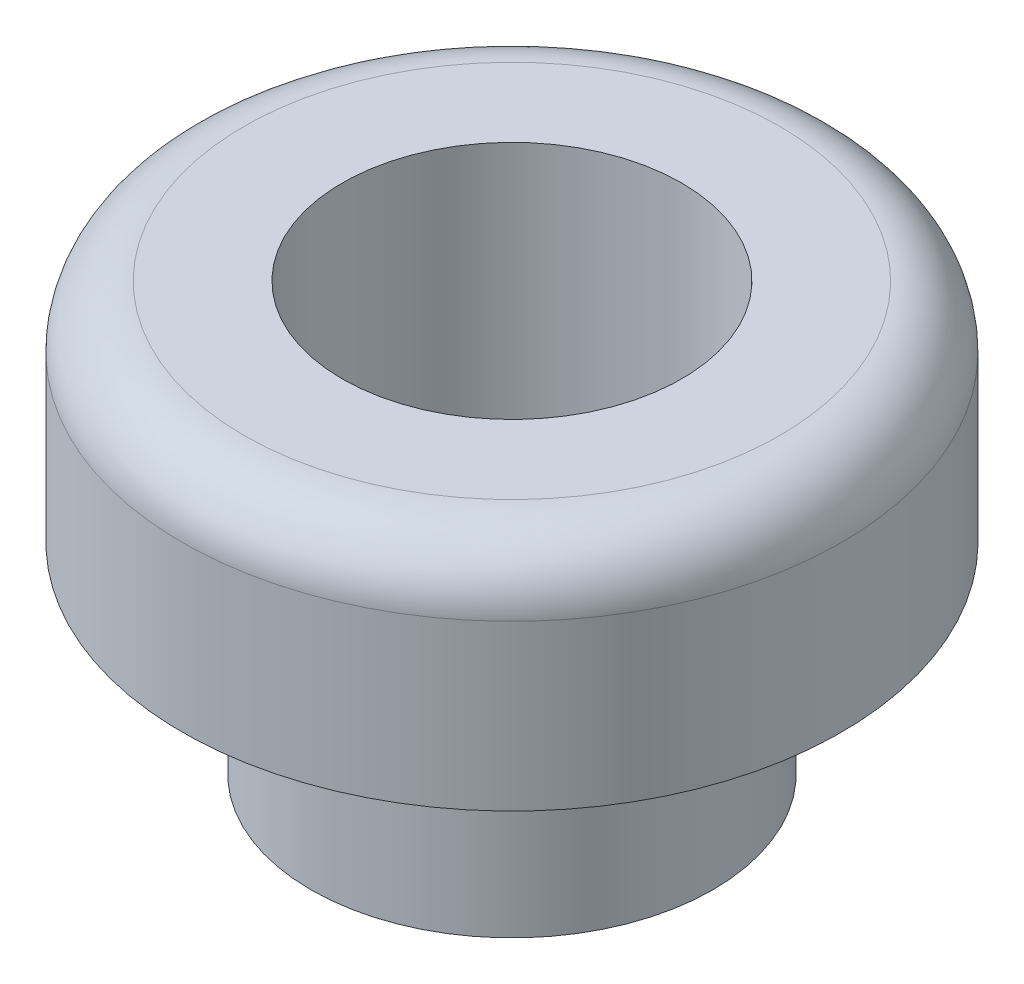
ISO-10303-21;
HEADER;
FILE_DESCRIPTION(('STEP AP214'),'2;1');
FILE_NAME('part.step','',(''),(''),'','','');
FILE_SCHEMA(('AUTOMOTIVE_DESIGN { 1 0 10303 214 1 1 1 1 }'));
ENDSEC;
DATA;
#1=APPLICATION_CONTEXT('core data for automotive mechanical design processes');
#2=APPLICATION_PROTOCOL_DEFINITION('international standard','automotive_design',2000,#1);
#3=PRODUCT_CONTEXT('',#1,'mechanical');
#4=PRODUCT('Part','Part','',(#3));
#5=PRODUCT_RELATED_PRODUCT_CATEGORY('part','',(#4));
#6=PRODUCT_DEFINITION_FORMATION('','',#4);
#7=PRODUCT_DEFINITION_CONTEXT('part definition',#1,'design');
#8=PRODUCT_DEFINITION('design','',#6,#7);
#9=PRODUCT_DEFINITION_SHAPE('','',#8);
#10=(LENGTH_UNIT() NAMED_UNIT(*) SI_UNIT(.MILLI.,.METRE.));
#11=(NAMED_UNIT(*) PLANE_ANGLE_UNIT() SI_UNIT($,.RADIAN.));
#12=(NAMED_UNIT(*) SI_UNIT($,.STERADIAN.) SOLID_ANGLE_UNIT());
#13=UNCERTAINTY_MEASURE_WITH_UNIT(LENGTH_MEASURE(1.E-05),#10,'distance_accuracy_value','');
#14=(GEOMETRIC_REPRESENTATION_CONTEXT(3) GLOBAL_UNCERTAINTY_ASSIGNED_CONTEXT((#13)) GLOBAL_UNIT_ASSIGNED_CONTEXT((#10,
#11,#12)) REPRESENTATION_CONTEXT('',''));
#15=CARTESIAN_POINT('',(0.,0.,0.));
#16=DIRECTION('',(0.,0.,1.));
#17=DIRECTION('',(1.,0.,0.));
#18=AXIS2_PLACEMENT_3D('',#15,#16,#17);
#19=CARTESIAN_POINT('',(7.747,0.,0.));
#20=DIRECTION('',(0.,-1.,0.));
#21=DIRECTION('',(0.,0.,-1.));
#22=AXIS2_PLACEMENT_3D('',#19,#20,#21);
#23=PLANE('',#22);
#24=CARTESIAN_POINT('',(0.,0.,0.));
#25=DIRECTION('',(0.,-1.,0.));
#26=DIRECTION('',(0.,0.,-1.));
#27=AXIS2_PLACEMENT_3D('',#24,#25,#26);
#28=CIRCLE('',#27,7.747);
#29=CARTESIAN_POINT('',(0.,0.,-7.747));
#30=VERTEX_POINT('',#29);
#31=EDGE_CURVE('E36',#30,#30,#28,.T.);
#32=ORIENTED_EDGE('',*,*,#31,.F.);
#33=EDGE_LOOP('',(#32));
#34=FACE_BOUND('',#33,.T.);
#35=CARTESIAN_POINT('',(0.,0.,0.));
#36=DIRECTION('',(0.,-1.,0.));
#37=DIRECTION('',(0.,0.,-1.));
#38=AXIS2_PLACEMENT_3D('',#35,#36,#37);
#39=CIRCLE('',#38,12.7);
#40=CARTESIAN_POINT('',(0.,0.,-12.7));
#41=VERTEX_POINT('',#40);
#42=EDGE_CURVE('E16',#41,#41,#39,.F.);
#43=ORIENTED_EDGE('',*,*,#42,.F.);
#44=EDGE_LOOP('',(#43));
#45=FACE_BOUND('',#44,.T.);
#46=ADVANCED_FACE('F13',(#34,#45),#23,.T.);
#47=CARTESIAN_POINT('',(0.,-1.8628768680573,0.));
#48=DIRECTION('',(0.,-1.,0.));
#49=DIRECTION('',(0.,0.,-1.));
#50=AXIS2_PLACEMENT_3D('',#47,#48,#49);
#51=CYLINDRICAL_SURFACE('',#50,12.7);
#52=ORIENTED_EDGE('',*,*,#42,.T.);
#53=EDGE_LOOP('',(#52));
#54=FACE_BOUND('',#53,.T.);
#55=CARTESIAN_POINT('',(0.,6.33222,0.));
#56=DIRECTION('',(0.,-1.,0.));
#57=DIRECTION('',(0.,0.,-1.));
#58=AXIS2_PLACEMENT_3D('',#55,#56,#57);
#59=CIRCLE('',#58,12.7);
#60=CARTESIAN_POINT('',(0.,6.33222,-12.7));
#61=VERTEX_POINT('',#60);
#62=EDGE_CURVE('E35',#61,#61,#59,.F.);
#63=ORIENTED_EDGE('',*,*,#62,.F.);
#64=EDGE_LOOP('',(#63));
#65=FACE_BOUND('',#64,.T.);
#66=ADVANCED_FACE('F45',(#54,#65),#51,.T.);
#67=CARTESIAN_POINT('',(0.,-1.8628768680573,0.));
#68=DIRECTION('',(0.,-1.,0.));
#69=DIRECTION('',(0.,0.,-1.));
#70=AXIS2_PLACEMENT_3D('',#67,#68,#69);
#71=CYLINDRICAL_SURFACE('',#70,7.747);
#72=ORIENTED_EDGE('',*,*,#31,.T.);
#73=EDGE_LOOP('',(#72));
#74=FACE_BOUND('',#73,.T.);
#75=CARTESIAN_POINT('',(0.,-7.7343,0.));
#76=DIRECTION('',(0.,-1.,0.));
#77=DIRECTION('',(0.,0.,-1.));
#78=AXIS2_PLACEMENT_3D('',#75,#76,#77);
#79=CIRCLE('',#78,7.747);
#80=CARTESIAN_POINT('',(0.,-7.7343,-7.747));
#81=VERTEX_POINT('',#80);
#82=EDGE_CURVE('E33',#81,#81,#79,.F.);
#83=ORIENTED_EDGE('',*,*,#82,.T.);
#84=EDGE_LOOP('',(#83));
#85=FACE_BOUND('',#84,.T.);
#86=ADVANCED_FACE('F54',(#74,#85),#71,.T.);
#87=CARTESIAN_POINT('',(0.,6.33222,0.));
#88=DIRECTION('',(0.,-1.,0.));
#89=DIRECTION('',(0.,0.,-1.));
#90=AXIS2_PLACEMENT_3D('',#87,#88,#89);
#91=TOROIDAL_SURFACE('',#90,10.32002,2.37998);
#92=ORIENTED_EDGE('',*,*,#62,.T.);
#93=EDGE_LOOP('',(#92));
#94=FACE_BOUND('',#93,.T.);
#95=CARTESIAN_POINT('',(0.,8.7122,0.));
#96=DIRECTION('',(0.,-1.,0.));
#97=DIRECTION('',(0.,0.,-1.));
#98=AXIS2_PLACEMENT_3D('',#95,#96,#97);
#99=CIRCLE('',#98,10.32002);
#100=CARTESIAN_POINT('',(0.,8.7122,-10.32002));
#101=VERTEX_POINT('',#100);
#102=EDGE_CURVE('E25',#101,#101,#99,.F.);
#103=ORIENTED_EDGE('',*,*,#102,.F.);
#104=EDGE_LOOP('',(#103));
#105=FACE_BOUND('',#104,.T.);
#106=ADVANCED_FACE('F81',(#94,#105),#91,.T.);
#107=CARTESIAN_POINT('',(0.,-7.7343,0.));
#108=DIRECTION('',(0.,1.,0.));
#109=DIRECTION('',(0.,0.,1.));
#110=AXIS2_PLACEMENT_3D('',#107,#108,#109);
#111=PLANE('',#110);
#112=CARTESIAN_POINT('',(0.,-7.7343,0.));
#113=DIRECTION('',(0.,-1.,0.));
#114=DIRECTION('',(0.,0.,-1.));
#115=AXIS2_PLACEMENT_3D('',#112,#113,#114);
#116=CIRCLE('',#115,6.5405);
#117=CARTESIAN_POINT('',(0.,-7.7343,-6.5405));
#118=VERTEX_POINT('',#117);
#119=EDGE_CURVE('E20',#118,#118,#116,.F.);
#120=ORIENTED_EDGE('',*,*,#119,.T.);
#121=EDGE_LOOP('',(#120));
#122=FACE_BOUND('',#121,.T.);
#123=ORIENTED_EDGE('',*,*,#82,.F.);
#124=EDGE_LOOP('',(#123));
#125=FACE_BOUND('',#124,.T.);
#126=ADVANCED_FACE('F63',(#122,#125),#111,.F.);
#127=CARTESIAN_POINT('',(10.32002,8.7122,0.));
#128=DIRECTION('',(0.,1.,0.));
#129=DIRECTION('',(0.,0.,1.));
#130=AXIS2_PLACEMENT_3D('',#127,#128,#129);
#131=PLANE('',#130);
#132=CARTESIAN_POINT('',(0.,8.7122,0.));
#133=DIRECTION('',(0.,-1.,0.));
#134=DIRECTION('',(0.,0.,-1.));
#135=AXIS2_PLACEMENT_3D('',#132,#133,#134);
#136=CIRCLE('',#135,6.5405);
#137=CARTESIAN_POINT('',(0.,8.7122,-6.5405));
#138=VERTEX_POINT('',#137);
#139=EDGE_CURVE('E9',#138,#138,#136,.T.);
#140=ORIENTED_EDGE('',*,*,#139,.T.);
#141=EDGE_LOOP('',(#140));
#142=FACE_BOUND('',#141,.T.);
#143=ORIENTED_EDGE('',*,*,#102,.T.);
#144=EDGE_LOOP('',(#143));
#145=FACE_BOUND('',#144,.T.);
#146=ADVANCED_FACE('F57',(#142,#145),#131,.T.);
#147=CARTESIAN_POINT('',(0.,-1.8628768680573,0.));
#148=DIRECTION('',(0.,-1.,0.));
#149=DIRECTION('',(0.,0.,-1.));
#150=AXIS2_PLACEMENT_3D('',#147,#148,#149);
#151=CYLINDRICAL_SURFACE('',#150,6.5405);
#152=ORIENTED_EDGE('',*,*,#139,.F.);
#153=EDGE_LOOP('',(#152));
#154=FACE_BOUND('',#153,.T.);
#155=ORIENTED_EDGE('',*,*,#119,.F.);
#156=EDGE_LOOP('',(#155));
#157=FACE_BOUND('',#156,.T.);
#158=ADVANCED_FACE('F55',(#154,#157),#151,.F.);
#159=CLOSED_SHELL('',(#46,#66,#86,#106,#126,#146,#158));
#160=MANIFOLD_SOLID_BREP('B1',#159);
#161=ADVANCED_BREP_SHAPE_REPRESENTATION('',(#18,#160),#14);
#162=SHAPE_DEFINITION_REPRESENTATION(#9,#161);
ENDSEC;
END-ISO-10303-21;
